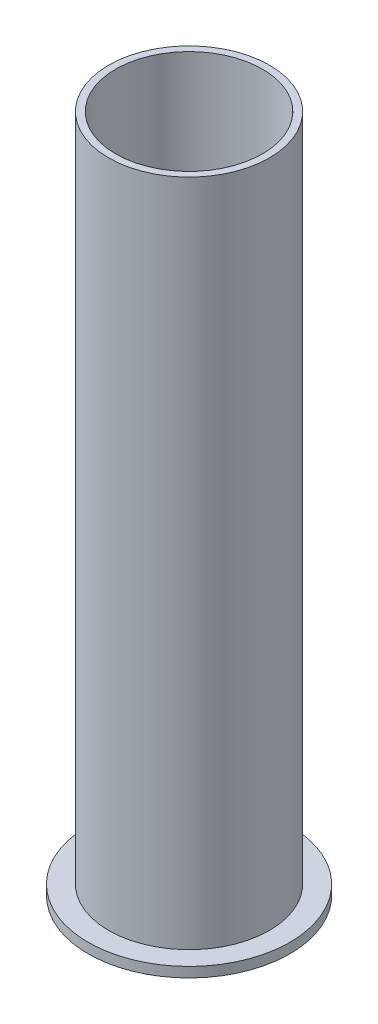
ISO-10303-21;
HEADER;
FILE_DESCRIPTION(('STEP AP214'),'2;1');
FILE_NAME('part.step','',(''),(''),'','','');
FILE_SCHEMA(('AUTOMOTIVE_DESIGN { 1 0 10303 214 1 1 1 1 }'));
ENDSEC;
DATA;
#1=APPLICATION_CONTEXT('core data for automotive mechanical design processes');
#2=APPLICATION_PROTOCOL_DEFINITION('international standard','automotive_design',2000,#1);
#3=PRODUCT_CONTEXT('',#1,'mechanical');
#4=PRODUCT('Part','Part','',(#3));
#5=PRODUCT_RELATED_PRODUCT_CATEGORY('part','',(#4));
#6=PRODUCT_DEFINITION_FORMATION('','',#4);
#7=PRODUCT_DEFINITION_CONTEXT('part definition',#1,'design');
#8=PRODUCT_DEFINITION('design','',#6,#7);
#9=PRODUCT_DEFINITION_SHAPE('','',#8);
#10=(LENGTH_UNIT() NAMED_UNIT(*) SI_UNIT(.MILLI.,.METRE.));
#11=(NAMED_UNIT(*) PLANE_ANGLE_UNIT() SI_UNIT($,.RADIAN.));
#12=(NAMED_UNIT(*) SI_UNIT($,.STERADIAN.) SOLID_ANGLE_UNIT());
#13=UNCERTAINTY_MEASURE_WITH_UNIT(LENGTH_MEASURE(1.E-05),#10,'distance_accuracy_value','');
#14=(GEOMETRIC_REPRESENTATION_CONTEXT(3) GLOBAL_UNCERTAINTY_ASSIGNED_CONTEXT((#13)) GLOBAL_UNIT_ASSIGNED_CONTEXT((#10,
#11,#12)) REPRESENTATION_CONTEXT('',''));
#15=CARTESIAN_POINT('',(0.,0.,0.));
#16=DIRECTION('',(0.,0.,1.));
#17=DIRECTION('',(1.,0.,0.));
#18=AXIS2_PLACEMENT_3D('',#15,#16,#17);
#19=CARTESIAN_POINT('',(0.,53.4416,0.));
#20=DIRECTION('',(0.,-1.,0.));
#21=DIRECTION('',(0.,0.,-1.));
#22=AXIS2_PLACEMENT_3D('',#19,#20,#21);
#23=CYLINDRICAL_SURFACE('',#22,6.3246);
#24=CARTESIAN_POINT('',(0.,53.4416,0.));
#25=DIRECTION('',(0.,1.,0.));
#26=DIRECTION('',(0.,0.,1.));
#27=AXIS2_PLACEMENT_3D('',#24,#25,#26);
#28=CIRCLE('',#27,6.3246);
#29=CARTESIAN_POINT('',(0.,53.4416,6.3246));
#30=VERTEX_POINT('',#29);
#31=EDGE_CURVE('E33',#30,#30,#28,.T.);
#32=ORIENTED_EDGE('',*,*,#31,.F.);
#33=EDGE_LOOP('',(#32));
#34=FACE_BOUND('',#33,.T.);
#35=CARTESIAN_POINT('',(0.,0.787400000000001,0.));
#36=DIRECTION('',(0.,-1.,0.));
#37=DIRECTION('',(0.,0.,-1.));
#38=AXIS2_PLACEMENT_3D('',#35,#36,#37);
#39=CIRCLE('',#38,6.3246);
#40=CARTESIAN_POINT('',(0.,0.787400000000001,-6.3246));
#41=VERTEX_POINT('',#40);
#42=EDGE_CURVE('E10',#41,#41,#39,.T.);
#43=ORIENTED_EDGE('',*,*,#42,.F.);
#44=EDGE_LOOP('',(#43));
#45=FACE_BOUND('',#44,.T.);
#46=ADVANCED_FACE('F30',(#34,#45),#23,.T.);
#47=CARTESIAN_POINT('',(0.,53.4416,0.));
#48=DIRECTION('',(0.,1.,0.));
#49=DIRECTION('',(0.,0.,1.));
#50=AXIS2_PLACEMENT_3D('',#47,#48,#49);
#51=PLANE('',#50);
#52=ORIENTED_EDGE('',*,*,#31,.T.);
#53=EDGE_LOOP('',(#52));
#54=FACE_BOUND('',#53,.T.);
#55=CARTESIAN_POINT('',(0.,53.4416,0.));
#56=DIRECTION('',(0.,1.,0.));
#57=DIRECTION('',(0.,0.,1.));
#58=AXIS2_PLACEMENT_3D('',#55,#56,#57);
#59=CIRCLE('',#58,5.7785);
#60=CARTESIAN_POINT('',(0.,53.4416,5.7785));
#61=VERTEX_POINT('',#60);
#62=EDGE_CURVE('E41',#61,#61,#59,.T.);
#63=ORIENTED_EDGE('',*,*,#62,.F.);
#64=EDGE_LOOP('',(#63));
#65=FACE_BOUND('',#64,.T.);
#66=ADVANCED_FACE('F72',(#54,#65),#51,.T.);
#67=CARTESIAN_POINT('',(0.,0.,0.));
#68=DIRECTION('',(0.,1.,0.));
#69=DIRECTION('',(0.,0.,1.));
#70=AXIS2_PLACEMENT_3D('',#67,#68,#69);
#71=PLANE('',#70);
#72=CARTESIAN_POINT('',(0.,0.,0.));
#73=DIRECTION('',(0.,1.,0.));
#74=DIRECTION('',(0.,0.,1.));
#75=AXIS2_PLACEMENT_3D('',#72,#73,#74);
#76=CIRCLE('',#75,5.7785);
#77=CARTESIAN_POINT('',(0.,0.,5.7785));
#78=VERTEX_POINT('',#77);
#79=EDGE_CURVE('E47',#78,#78,#76,.T.);
#80=ORIENTED_EDGE('',*,*,#79,.T.);
#81=EDGE_LOOP('',(#80));
#82=FACE_BOUND('',#81,.T.);
#83=CARTESIAN_POINT('',(0.,0.,0.));
#84=DIRECTION('',(0.,-1.,0.));
#85=DIRECTION('',(0.,0.,-1.));
#86=AXIS2_PLACEMENT_3D('',#83,#84,#85);
#87=CIRCLE('',#86,7.9375);
#88=CARTESIAN_POINT('',(0.,0.,-7.9375));
#89=VERTEX_POINT('',#88);
#90=EDGE_CURVE('E44',#89,#89,#87,.T.);
#91=ORIENTED_EDGE('',*,*,#90,.T.);
#92=EDGE_LOOP('',(#91));
#93=FACE_BOUND('',#92,.T.);
#94=ADVANCED_FACE('F58',(#82,#93),#71,.F.);
#95=CARTESIAN_POINT('',(0.,53.4416,0.));
#96=DIRECTION('',(0.,-1.,0.));
#97=DIRECTION('',(0.,0.,-1.));
#98=AXIS2_PLACEMENT_3D('',#95,#96,#97);
#99=CYLINDRICAL_SURFACE('',#98,5.7785);
#100=ORIENTED_EDGE('',*,*,#79,.F.);
#101=EDGE_LOOP('',(#100));
#102=FACE_BOUND('',#101,.T.);
#103=ORIENTED_EDGE('',*,*,#62,.T.);
#104=EDGE_LOOP('',(#103));
#105=FACE_BOUND('',#104,.T.);
#106=ADVANCED_FACE('F67',(#102,#105),#99,.F.);
#107=CARTESIAN_POINT('',(0.,0.7874,0.));
#108=DIRECTION('',(0.,-1.,0.));
#109=DIRECTION('',(0.,0.,-1.));
#110=AXIS2_PLACEMENT_3D('',#107,#108,#109);
#111=PLANE('',#110);
#112=CARTESIAN_POINT('',(0.,0.7874,0.));
#113=DIRECTION('',(0.,-1.,0.));
#114=DIRECTION('',(0.,0.,-1.));
#115=AXIS2_PLACEMENT_3D('',#112,#113,#114);
#116=CIRCLE('',#115,7.9375);
#117=CARTESIAN_POINT('',(0.,0.7874,-7.9375));
#118=VERTEX_POINT('',#117);
#119=EDGE_CURVE('E49',#118,#118,#116,.T.);
#120=ORIENTED_EDGE('',*,*,#119,.F.);
#121=EDGE_LOOP('',(#120));
#122=FACE_BOUND('',#121,.T.);
#123=ORIENTED_EDGE('',*,*,#42,.T.);
#124=EDGE_LOOP('',(#123));
#125=FACE_BOUND('',#124,.T.);
#126=ADVANCED_FACE('F62',(#122,#125),#111,.F.);
#127=CARTESIAN_POINT('',(0.,0.7874,0.));
#128=DIRECTION('',(0.,-1.,0.));
#129=DIRECTION('',(0.,0.,-1.));
#130=AXIS2_PLACEMENT_3D('',#127,#128,#129);
#131=CYLINDRICAL_SURFACE('',#130,7.9375);
#132=ORIENTED_EDGE('',*,*,#119,.T.);
#133=EDGE_LOOP('',(#132));
#134=FACE_BOUND('',#133,.T.);
#135=ORIENTED_EDGE('',*,*,#90,.F.);
#136=EDGE_LOOP('',(#135));
#137=FACE_BOUND('',#136,.T.);
#138=ADVANCED_FACE('F60',(#134,#137),#131,.T.);
#139=CLOSED_SHELL('',(#46,#66,#94,#106,#126,#138));
#140=MANIFOLD_SOLID_BREP('B2',#139);
#141=ADVANCED_BREP_SHAPE_REPRESENTATION('',(#18,#140),#14);
#142=SHAPE_DEFINITION_REPRESENTATION(#9,#141);
ENDSEC;
END-ISO-10303-21;
